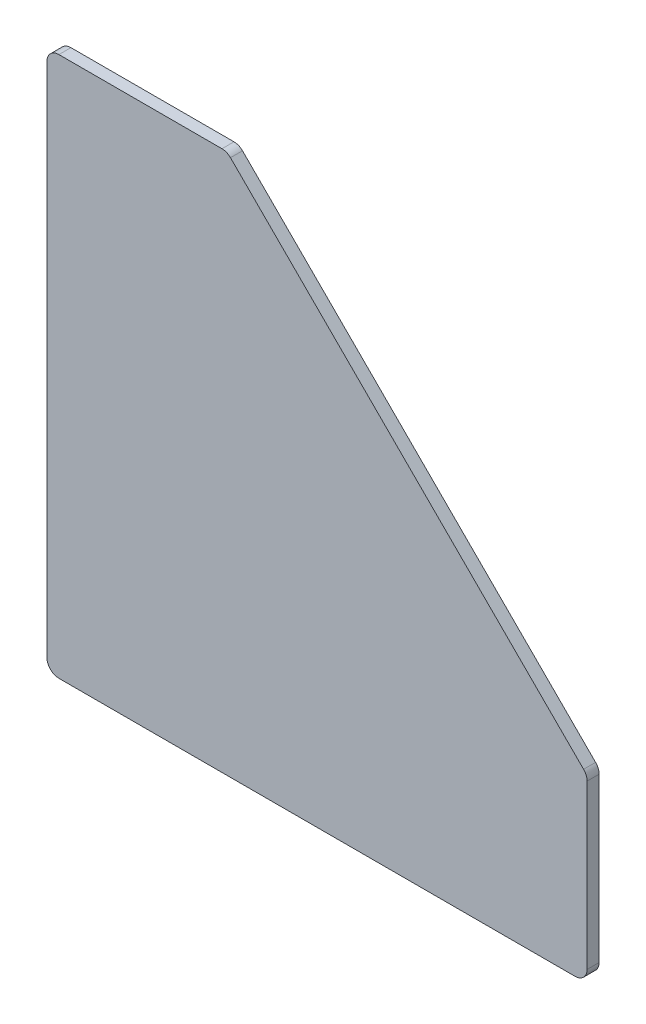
ISO-10303-21;
HEADER;
FILE_DESCRIPTION(('STEP AP214'),'2;1');
FILE_NAME('part.step','',(''),(''),'','','');
FILE_SCHEMA(('AUTOMOTIVE_DESIGN { 1 0 10303 214 1 1 1 1 }'));
ENDSEC;
DATA;
#1=APPLICATION_CONTEXT('core data for automotive mechanical design processes');
#2=APPLICATION_PROTOCOL_DEFINITION('international standard','automotive_design',2000,#1);
#3=PRODUCT_CONTEXT('',#1,'mechanical');
#4=PRODUCT('Part','Part','',(#3));
#5=PRODUCT_RELATED_PRODUCT_CATEGORY('part','',(#4));
#6=PRODUCT_DEFINITION_FORMATION('','',#4);
#7=PRODUCT_DEFINITION_CONTEXT('part definition',#1,'design');
#8=PRODUCT_DEFINITION('design','',#6,#7);
#9=PRODUCT_DEFINITION_SHAPE('','',#8);
#10=(LENGTH_UNIT() NAMED_UNIT(*) SI_UNIT(.MILLI.,.METRE.));
#11=(NAMED_UNIT(*) PLANE_ANGLE_UNIT() SI_UNIT($,.RADIAN.));
#12=(NAMED_UNIT(*) SI_UNIT($,.STERADIAN.) SOLID_ANGLE_UNIT());
#13=UNCERTAINTY_MEASURE_WITH_UNIT(LENGTH_MEASURE(1.E-05),#10,'distance_accuracy_value','');
#14=(GEOMETRIC_REPRESENTATION_CONTEXT(3) GLOBAL_UNCERTAINTY_ASSIGNED_CONTEXT((#13)) GLOBAL_UNIT_ASSIGNED_CONTEXT((#10,
#11,#12)) REPRESENTATION_CONTEXT('',''));
#15=CARTESIAN_POINT('',(0.,0.,0.));
#16=DIRECTION('',(0.,0.,1.));
#17=DIRECTION('',(1.,0.,0.));
#18=AXIS2_PLACEMENT_3D('',#15,#16,#17);
#19=CARTESIAN_POINT('',(1.99999999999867,88.0000000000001,1.99999999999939));
#20=DIRECTION('',(0.,0.,-1.));
#21=DIRECTION('',(-1.,0.,0.));
#22=AXIS2_PLACEMENT_3D('',#19,#20,#21);
#23=CYLINDRICAL_SURFACE('',#22,2.);
#24=DIRECTION('',(0.,0.,-1.));
#25=VECTOR('',#24,1.);
#26=CARTESIAN_POINT('',(-1.33226762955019E-12,88.,1.9999999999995));
#27=LINE('',#26,#25);
#28=CARTESIAN_POINT('',(-1.33226762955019E-12,88.,1.9999999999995));
#29=VERTEX_POINT('',#28);
#30=CARTESIAN_POINT('',(-1.33226762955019E-12,88.,-2.77555756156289E-13));
#31=VERTEX_POINT('',#30);
#32=EDGE_CURVE('E11',#29,#31,#27,.T.);
#33=ORIENTED_EDGE('',*,*,#32,.F.);
#34=CARTESIAN_POINT('',(1.99999999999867,88.0000000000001,1.99999999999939));
#35=DIRECTION('',(0.,0.,-1.));
#36=DIRECTION('',(-1.,0.,0.));
#37=AXIS2_PLACEMENT_3D('',#34,#35,#36);
#38=CIRCLE('',#37,2.);
#39=CARTESIAN_POINT('',(1.99999999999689,90.0000000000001,1.99999999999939));
#40=VERTEX_POINT('',#39);
#41=EDGE_CURVE('E107',#29,#40,#38,.T.);
#42=ORIENTED_EDGE('',*,*,#41,.T.);
#43=DIRECTION('',(0.,0.,-1.));
#44=VECTOR('',#43,1.);
#45=CARTESIAN_POINT('',(1.99999999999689,90.0000000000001,1.99999999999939));
#46=LINE('',#45,#44);
#47=CARTESIAN_POINT('',(1.99999999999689,90.0000000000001,-6.10622663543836E-13));
#48=VERTEX_POINT('',#47);
#49=EDGE_CURVE('E103',#40,#48,#46,.T.);
#50=ORIENTED_EDGE('',*,*,#49,.T.);
#51=CARTESIAN_POINT('',(1.99999999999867,88.0000000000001,-6.10622663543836E-13));
#52=DIRECTION('',(0.,0.,-1.));
#53=DIRECTION('',(-1.,0.,0.));
#54=AXIS2_PLACEMENT_3D('',#51,#52,#53);
#55=CIRCLE('',#54,2.);
#56=EDGE_CURVE('E105',#31,#48,#55,.T.);
#57=ORIENTED_EDGE('',*,*,#56,.F.);
#58=EDGE_LOOP('',(#33,#42,#50,#57));
#59=FACE_BOUND('',#58,.T.);
#60=ADVANCED_FACE('F30',(#59),#23,.T.);
#61=CARTESIAN_POINT('',(-1.33226762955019E-12,88.,1.9999999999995));
#62=DIRECTION('',(1.,0.,0.));
#63=DIRECTION('',(0.,1.,0.));
#64=AXIS2_PLACEMENT_3D('',#61,#62,#63);
#65=PLANE('',#64);
#66=DIRECTION('',(0.,0.,-1.));
#67=VECTOR('',#66,1.);
#68=CARTESIAN_POINT('',(0.,2.00000000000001,2.));
#69=LINE('',#68,#67);
#70=CARTESIAN_POINT('',(0.,2.00000000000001,2.));
#71=VERTEX_POINT('',#70);
#72=CARTESIAN_POINT('',(0.,2.00000000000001,0.));
#73=VERTEX_POINT('',#72);
#74=EDGE_CURVE('E38',#71,#73,#69,.T.);
#75=ORIENTED_EDGE('',*,*,#74,.F.);
#76=DIRECTION('',(0.,-1.,0.));
#77=VECTOR('',#76,1.);
#78=CARTESIAN_POINT('',(-1.33226762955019E-12,88.,1.9999999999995));
#79=LINE('',#78,#77);
#80=EDGE_CURVE('E113',#29,#71,#79,.T.);
#81=ORIENTED_EDGE('',*,*,#80,.F.);
#82=ORIENTED_EDGE('',*,*,#32,.T.);
#83=DIRECTION('',(0.,-1.,0.));
#84=VECTOR('',#83,1.);
#85=CARTESIAN_POINT('',(-1.33226762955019E-12,88.,-2.77555756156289E-13));
#86=LINE('',#85,#84);
#87=EDGE_CURVE('E122',#31,#73,#86,.T.);
#88=ORIENTED_EDGE('',*,*,#87,.T.);
#89=EDGE_LOOP('',(#75,#81,#82,#88));
#90=FACE_BOUND('',#89,.T.);
#91=ADVANCED_FACE('F32',(#90),#65,.F.);
#92=CARTESIAN_POINT('',(2.,2.00000000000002,2.));
#93=DIRECTION('',(0.,0.,-1.));
#94=DIRECTION('',(-1.,0.,0.));
#95=AXIS2_PLACEMENT_3D('',#92,#93,#94);
#96=CYLINDRICAL_SURFACE('',#95,2.);
#97=DIRECTION('',(0.,0.,-1.));
#98=VECTOR('',#97,1.);
#99=CARTESIAN_POINT('',(2.,0.,2.));
#100=LINE('',#99,#98);
#101=CARTESIAN_POINT('',(2.,0.,2.));
#102=VERTEX_POINT('',#101);
#103=CARTESIAN_POINT('',(2.,0.,0.));
#104=VERTEX_POINT('',#103);
#105=EDGE_CURVE('E183',#102,#104,#100,.T.);
#106=ORIENTED_EDGE('',*,*,#105,.F.);
#107=CARTESIAN_POINT('',(2.,2.00000000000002,2.));
#108=DIRECTION('',(0.,0.,-1.));
#109=DIRECTION('',(-1.,0.,0.));
#110=AXIS2_PLACEMENT_3D('',#107,#108,#109);
#111=CIRCLE('',#110,2.);
#112=EDGE_CURVE('E168',#102,#71,#111,.T.);
#113=ORIENTED_EDGE('',*,*,#112,.T.);
#114=ORIENTED_EDGE('',*,*,#74,.T.);
#115=CARTESIAN_POINT('',(2.,2.,0.));
#116=DIRECTION('',(0.,0.,-1.));
#117=DIRECTION('',(-1.,0.,0.));
#118=AXIS2_PLACEMENT_3D('',#115,#116,#117);
#119=CIRCLE('',#118,2.);
#120=EDGE_CURVE('E144',#104,#73,#119,.T.);
#121=ORIENTED_EDGE('',*,*,#120,.F.);
#122=EDGE_LOOP('',(#106,#113,#114,#121));
#123=FACE_BOUND('',#122,.T.);
#124=ADVANCED_FACE('F186',(#123),#96,.T.);
#125=CARTESIAN_POINT('',(2.,0.,2.));
#126=DIRECTION('',(0.,1.,0.));
#127=DIRECTION('',(0.,0.,1.));
#128=AXIS2_PLACEMENT_3D('',#125,#126,#127);
#129=PLANE('',#128);
#130=DIRECTION('',(0.,0.,-1.));
#131=VECTOR('',#130,1.);
#132=CARTESIAN_POINT('',(88.0000000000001,3.33066907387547E-13,2.));
#133=LINE('',#132,#131);
#134=CARTESIAN_POINT('',(88.0000000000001,3.33066907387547E-13,2.));
#135=VERTEX_POINT('',#134);
#136=CARTESIAN_POINT('',(88.0000000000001,3.33066907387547E-13,0.));
#137=VERTEX_POINT('',#136);
#138=EDGE_CURVE('E181',#135,#137,#133,.T.);
#139=ORIENTED_EDGE('',*,*,#138,.F.);
#140=DIRECTION('',(1.,0.,0.));
#141=VECTOR('',#140,1.);
#142=CARTESIAN_POINT('',(2.,0.,2.));
#143=LINE('',#142,#141);
#144=EDGE_CURVE('E165',#102,#135,#143,.T.);
#145=ORIENTED_EDGE('',*,*,#144,.F.);
#146=ORIENTED_EDGE('',*,*,#105,.T.);
#147=DIRECTION('',(1.,0.,0.));
#148=VECTOR('',#147,1.);
#149=CARTESIAN_POINT('',(2.,0.,0.));
#150=LINE('',#149,#148);
#151=EDGE_CURVE('E141',#104,#137,#150,.T.);
#152=ORIENTED_EDGE('',*,*,#151,.T.);
#153=EDGE_LOOP('',(#139,#145,#146,#152));
#154=FACE_BOUND('',#153,.T.);
#155=ADVANCED_FACE('F211',(#154),#129,.F.);
#156=CARTESIAN_POINT('',(88.0000000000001,2.00000000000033,2.));
#157=DIRECTION('',(0.,0.,-1.));
#158=DIRECTION('',(-1.,0.,0.));
#159=AXIS2_PLACEMENT_3D('',#156,#157,#158);
#160=CYLINDRICAL_SURFACE('',#159,2.);
#161=DIRECTION('',(0.,0.,-1.));
#162=VECTOR('',#161,1.);
#163=CARTESIAN_POINT('',(90.0000000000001,2.00000000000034,2.));
#164=LINE('',#163,#162);
#165=CARTESIAN_POINT('',(90.0000000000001,2.00000000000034,2.));
#166=VERTEX_POINT('',#165);
#167=CARTESIAN_POINT('',(90.0000000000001,2.00000000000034,0.));
#168=VERTEX_POINT('',#167);
#169=EDGE_CURVE('E179',#166,#168,#164,.T.);
#170=ORIENTED_EDGE('',*,*,#169,.F.);
#171=CARTESIAN_POINT('',(88.0000000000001,2.00000000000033,2.));
#172=DIRECTION('',(0.,0.,1.));
#173=DIRECTION('',(1.,0.,0.));
#174=AXIS2_PLACEMENT_3D('',#171,#172,#173);
#175=CIRCLE('',#174,2.);
#176=EDGE_CURVE('E162',#135,#166,#175,.T.);
#177=ORIENTED_EDGE('',*,*,#176,.F.);
#178=ORIENTED_EDGE('',*,*,#138,.T.);
#179=CARTESIAN_POINT('',(88.0000000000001,2.00000000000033,0.));
#180=DIRECTION('',(0.,0.,1.));
#181=DIRECTION('',(1.,0.,0.));
#182=AXIS2_PLACEMENT_3D('',#179,#180,#181);
#183=CIRCLE('',#182,2.);
#184=EDGE_CURVE('E138',#137,#168,#183,.T.);
#185=ORIENTED_EDGE('',*,*,#184,.T.);
#186=EDGE_LOOP('',(#170,#177,#178,#185));
#187=FACE_BOUND('',#186,.T.);
#188=ADVANCED_FACE('F209',(#187),#160,.T.);
#189=CARTESIAN_POINT('',(90.0000000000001,2.00000000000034,2.));
#190=DIRECTION('',(-1.,0.,0.));
#191=DIRECTION('',(0.,-1.,0.));
#192=AXIS2_PLACEMENT_3D('',#189,#190,#191);
#193=PLANE('',#192);
#194=DIRECTION('',(0.,0.,-1.));
#195=VECTOR('',#194,1.);
#196=CARTESIAN_POINT('',(90.0000000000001,29.1715728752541,2.));
#197=LINE('',#196,#195);
#198=CARTESIAN_POINT('',(90.0000000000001,29.1715728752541,2.));
#199=VERTEX_POINT('',#198);
#200=CARTESIAN_POINT('',(90.0000000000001,29.1715728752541,0.));
#201=VERTEX_POINT('',#200);
#202=EDGE_CURVE('E177',#199,#201,#197,.T.);
#203=ORIENTED_EDGE('',*,*,#202,.F.);
#204=DIRECTION('',(0.,1.,0.));
#205=VECTOR('',#204,1.);
#206=CARTESIAN_POINT('',(90.0000000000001,2.00000000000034,2.));
#207=LINE('',#206,#205);
#208=EDGE_CURVE('E159',#166,#199,#207,.T.);
#209=ORIENTED_EDGE('',*,*,#208,.F.);
#210=ORIENTED_EDGE('',*,*,#169,.T.);
#211=DIRECTION('',(0.,1.,0.));
#212=VECTOR('',#211,1.);
#213=CARTESIAN_POINT('',(90.0000000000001,2.00000000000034,0.));
#214=LINE('',#213,#212);
#215=EDGE_CURVE('E135',#168,#201,#214,.T.);
#216=ORIENTED_EDGE('',*,*,#215,.T.);
#217=EDGE_LOOP('',(#203,#209,#210,#216));
#218=FACE_BOUND('',#217,.T.);
#219=ADVANCED_FACE('F205',(#218),#193,.F.);
#220=CARTESIAN_POINT('',(88.0000000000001,29.1715728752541,2.));
#221=DIRECTION('',(0.,0.,-1.));
#222=DIRECTION('',(-1.,0.,0.));
#223=AXIS2_PLACEMENT_3D('',#220,#221,#222);
#224=CYLINDRICAL_SURFACE('',#223,2.);
#225=DIRECTION('',(0.,0.,-1.));
#226=VECTOR('',#225,1.);
#227=CARTESIAN_POINT('',(89.414213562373,30.5857864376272,2.));
#228=LINE('',#227,#226);
#229=CARTESIAN_POINT('',(89.414213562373,30.5857864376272,2.));
#230=VERTEX_POINT('',#229);
#231=CARTESIAN_POINT('',(89.414213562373,30.5857864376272,0.));
#232=VERTEX_POINT('',#231);
#233=EDGE_CURVE('E175',#230,#232,#228,.T.);
#234=ORIENTED_EDGE('',*,*,#233,.F.);
#235=CARTESIAN_POINT('',(88.0000000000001,29.1715728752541,2.));
#236=DIRECTION('',(0.,0.,1.));
#237=DIRECTION('',(1.,0.,0.));
#238=AXIS2_PLACEMENT_3D('',#235,#236,#237);
#239=CIRCLE('',#238,2.);
#240=EDGE_CURVE('E156',#199,#230,#239,.T.);
#241=ORIENTED_EDGE('',*,*,#240,.F.);
#242=ORIENTED_EDGE('',*,*,#202,.T.);
#243=CARTESIAN_POINT('',(88.0000000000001,29.1715728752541,0.));
#244=DIRECTION('',(0.,0.,1.));
#245=DIRECTION('',(1.,0.,0.));
#246=AXIS2_PLACEMENT_3D('',#243,#244,#245);
#247=CIRCLE('',#246,2.);
#248=EDGE_CURVE('E132',#201,#232,#247,.T.);
#249=ORIENTED_EDGE('',*,*,#248,.T.);
#250=EDGE_LOOP('',(#234,#241,#242,#249));
#251=FACE_BOUND('',#250,.T.);
#252=ADVANCED_FACE('F202',(#251),#224,.T.);
#253=CARTESIAN_POINT('',(89.414213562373,30.5857864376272,2.));
#254=DIRECTION('',(-0.70710678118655,-0.70710678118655,0.));
#255=DIRECTION('',(0.707106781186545,-0.707106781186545,0.));
#256=AXIS2_PLACEMENT_3D('',#253,#254,#255);
#257=PLANE('',#256);
#258=DIRECTION('',(0.,0.,-1.));
#259=VECTOR('',#258,1.);
#260=CARTESIAN_POINT('',(30.5857864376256,89.4142135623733,2.));
#261=LINE('',#260,#259);
#262=CARTESIAN_POINT('',(30.5857864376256,89.4142135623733,2.));
#263=VERTEX_POINT('',#262);
#264=CARTESIAN_POINT('',(30.5857864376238,89.4142135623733,0.));
#265=VERTEX_POINT('',#264);
#266=EDGE_CURVE('E173',#263,#265,#261,.T.);
#267=ORIENTED_EDGE('',*,*,#266,.F.);
#268=DIRECTION('',(-0.707106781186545,0.707106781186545,0.));
#269=VECTOR('',#268,1.);
#270=CARTESIAN_POINT('',(89.414213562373,30.5857864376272,2.));
#271=LINE('',#270,#269);
#272=EDGE_CURVE('E153',#230,#263,#271,.T.);
#273=ORIENTED_EDGE('',*,*,#272,.F.);
#274=ORIENTED_EDGE('',*,*,#233,.T.);
#275=DIRECTION('',(-0.707106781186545,0.707106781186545,0.));
#276=VECTOR('',#275,1.);
#277=CARTESIAN_POINT('',(89.414213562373,30.5857864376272,0.));
#278=LINE('',#277,#276);
#279=EDGE_CURVE('E127',#232,#265,#278,.T.);
#280=ORIENTED_EDGE('',*,*,#279,.T.);
#281=EDGE_LOOP('',(#267,#273,#274,#280));
#282=FACE_BOUND('',#281,.T.);
#283=ADVANCED_FACE('F199',(#282),#257,.F.);
#284=CARTESIAN_POINT('',(29.1715728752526,88.0000000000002,2.));
#285=DIRECTION('',(0.,0.,-1.));
#286=DIRECTION('',(-1.,0.,0.));
#287=AXIS2_PLACEMENT_3D('',#284,#285,#286);
#288=CYLINDRICAL_SURFACE('',#287,2.);
#289=DIRECTION('',(0.,0.,-1.));
#290=VECTOR('',#289,1.);
#291=CARTESIAN_POINT('',(29.1715728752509,90.0000000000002,2.));
#292=LINE('',#291,#290);
#293=CARTESIAN_POINT('',(29.1715728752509,90.0000000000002,2.));
#294=VERTEX_POINT('',#293);
#295=CARTESIAN_POINT('',(29.1715728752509,90.0000000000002,0.));
#296=VERTEX_POINT('',#295);
#297=EDGE_CURVE('E112',#294,#296,#292,.T.);
#298=ORIENTED_EDGE('',*,*,#297,.F.);
#299=CARTESIAN_POINT('',(29.1715728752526,88.0000000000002,2.));
#300=DIRECTION('',(0.,0.,1.));
#301=DIRECTION('',(1.,0.,0.));
#302=AXIS2_PLACEMENT_3D('',#299,#300,#301);
#303=CIRCLE('',#302,2.);
#304=EDGE_CURVE('E150',#263,#294,#303,.T.);
#305=ORIENTED_EDGE('',*,*,#304,.F.);
#306=ORIENTED_EDGE('',*,*,#266,.T.);
#307=CARTESIAN_POINT('',(29.1715728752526,88.0000000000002,0.));
#308=DIRECTION('',(0.,0.,1.));
#309=DIRECTION('',(1.,0.,0.));
#310=AXIS2_PLACEMENT_3D('',#307,#308,#309);
#311=CIRCLE('',#310,2.);
#312=EDGE_CURVE('E125',#265,#296,#311,.T.);
#313=ORIENTED_EDGE('',*,*,#312,.T.);
#314=EDGE_LOOP('',(#298,#305,#306,#313));
#315=FACE_BOUND('',#314,.T.);
#316=ADVANCED_FACE('F195',(#315),#288,.T.);
#317=CARTESIAN_POINT('',(29.1715728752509,90.0000000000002,2.));
#318=DIRECTION('',(0.,-1.,0.));
#319=DIRECTION('',(0.,0.,-1.));
#320=AXIS2_PLACEMENT_3D('',#317,#318,#319);
#321=PLANE('',#320);
#322=DIRECTION('',(-1.,0.,0.));
#323=VECTOR('',#322,1.);
#324=CARTESIAN_POINT('',(29.1715728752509,90.0000000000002,2.));
#325=LINE('',#324,#323);
#326=EDGE_CURVE('E148',#294,#40,#325,.T.);
#327=ORIENTED_EDGE('',*,*,#326,.F.);
#328=ORIENTED_EDGE('',*,*,#297,.T.);
#329=DIRECTION('',(-1.,0.,0.));
#330=VECTOR('',#329,1.);
#331=CARTESIAN_POINT('',(29.1715728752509,90.0000000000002,0.));
#332=LINE('',#331,#330);
#333=EDGE_CURVE('E119',#296,#48,#332,.T.);
#334=ORIENTED_EDGE('',*,*,#333,.T.);
#335=ORIENTED_EDGE('',*,*,#49,.F.);
#336=EDGE_LOOP('',(#327,#328,#334,#335));
#337=FACE_BOUND('',#336,.T.);
#338=ADVANCED_FACE('F124',(#337),#321,.F.);
#339=CARTESIAN_POINT('',(1.99999999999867,88.0000000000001,1.99999999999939));
#340=DIRECTION('',(0.,0.,-1.));
#341=DIRECTION('',(-1.,0.,0.));
#342=AXIS2_PLACEMENT_3D('',#339,#340,#341);
#343=PLANE('',#342);
#344=ORIENTED_EDGE('',*,*,#41,.F.);
#345=ORIENTED_EDGE('',*,*,#80,.T.);
#346=ORIENTED_EDGE('',*,*,#112,.F.);
#347=ORIENTED_EDGE('',*,*,#144,.T.);
#348=ORIENTED_EDGE('',*,*,#176,.T.);
#349=ORIENTED_EDGE('',*,*,#208,.T.);
#350=ORIENTED_EDGE('',*,*,#240,.T.);
#351=ORIENTED_EDGE('',*,*,#272,.T.);
#352=ORIENTED_EDGE('',*,*,#304,.T.);
#353=ORIENTED_EDGE('',*,*,#326,.T.);
#354=EDGE_LOOP('',(#344,#345,#346,#347,#348,#349,#350,#351,#352,#353));
#355=FACE_BOUND('',#354,.T.);
#356=ADVANCED_FACE('F191',(#355),#343,.F.);
#357=CARTESIAN_POINT('',(1.99999999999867,88.0000000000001,-6.10622663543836E-13));
#358=DIRECTION('',(0.,0.,-1.));
#359=DIRECTION('',(-1.,0.,0.));
#360=AXIS2_PLACEMENT_3D('',#357,#358,#359);
#361=PLANE('',#360);
#362=ORIENTED_EDGE('',*,*,#56,.T.);
#363=ORIENTED_EDGE('',*,*,#333,.F.);
#364=ORIENTED_EDGE('',*,*,#312,.F.);
#365=ORIENTED_EDGE('',*,*,#279,.F.);
#366=ORIENTED_EDGE('',*,*,#248,.F.);
#367=ORIENTED_EDGE('',*,*,#215,.F.);
#368=ORIENTED_EDGE('',*,*,#184,.F.);
#369=ORIENTED_EDGE('',*,*,#151,.F.);
#370=ORIENTED_EDGE('',*,*,#120,.T.);
#371=ORIENTED_EDGE('',*,*,#87,.F.);
#372=EDGE_LOOP('',(#362,#363,#364,#365,#366,#367,#368,#369,#370,#371));
#373=FACE_BOUND('',#372,.T.);
#374=ADVANCED_FACE('F117',(#373),#361,.T.);
#375=CLOSED_SHELL('',(#60,#91,#124,#155,#188,#219,#252,#283,#316,#338,#356,#374));
#376=MANIFOLD_SOLID_BREP('B2',#375);
#377=ADVANCED_BREP_SHAPE_REPRESENTATION('',(#18,#376),#14);
#378=SHAPE_DEFINITION_REPRESENTATION(#9,#377);
ENDSEC;
END-ISO-10303-21;
